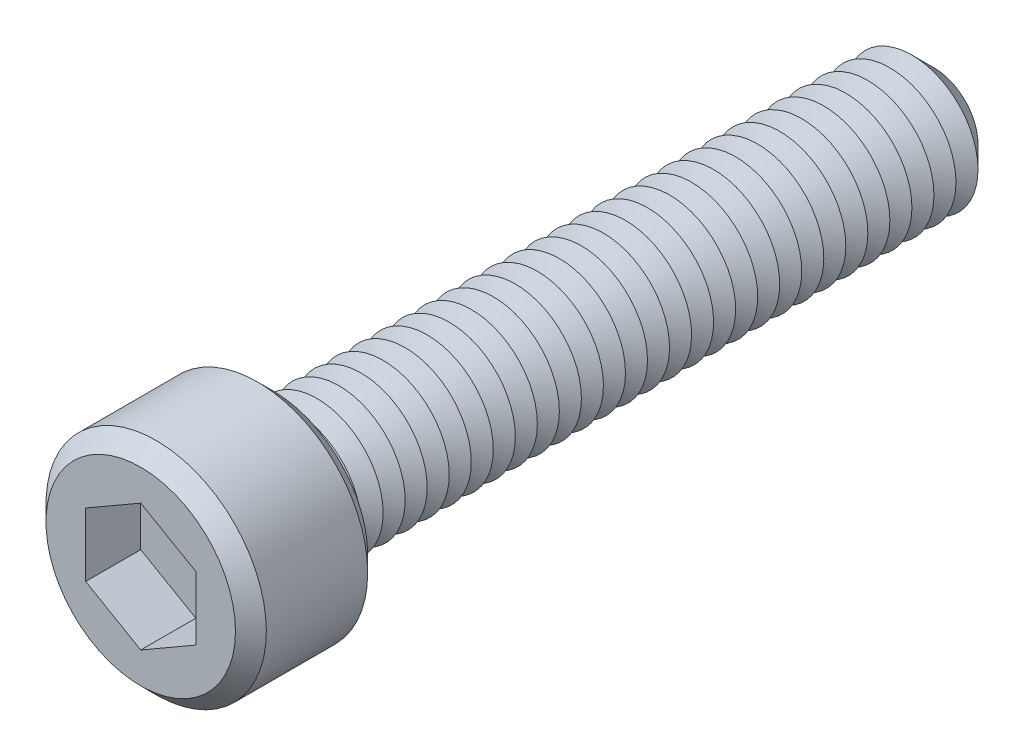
ISO-10303-21;
HEADER;
FILE_DESCRIPTION(('STEP AP214'),'2;1');
FILE_NAME('part.step','',(''),(''),'','','');
FILE_SCHEMA(('AUTOMOTIVE_DESIGN { 1 0 10303 214 1 1 1 1 }'));
ENDSEC;
DATA;
#1=APPLICATION_CONTEXT('core data for automotive mechanical design processes');
#2=APPLICATION_PROTOCOL_DEFINITION('international standard','automotive_design',2000,#1);
#3=PRODUCT_CONTEXT('',#1,'mechanical');
#4=PRODUCT('Part','Part','',(#3));
#5=PRODUCT_RELATED_PRODUCT_CATEGORY('part','',(#4));
#6=PRODUCT_DEFINITION_FORMATION('','',#4);
#7=PRODUCT_DEFINITION_CONTEXT('part definition',#1,'design');
#8=PRODUCT_DEFINITION('design','',#6,#7);
#9=PRODUCT_DEFINITION_SHAPE('','',#8);
#10=(LENGTH_UNIT() NAMED_UNIT(*) SI_UNIT(.MILLI.,.METRE.));
#11=(NAMED_UNIT(*) PLANE_ANGLE_UNIT() SI_UNIT($,.RADIAN.));
#12=(NAMED_UNIT(*) SI_UNIT($,.STERADIAN.) SOLID_ANGLE_UNIT());
#13=UNCERTAINTY_MEASURE_WITH_UNIT(LENGTH_MEASURE(1.E-05),#10,'distance_accuracy_value','');
#14=(GEOMETRIC_REPRESENTATION_CONTEXT(3) GLOBAL_UNCERTAINTY_ASSIGNED_CONTEXT((#13)) GLOBAL_UNIT_ASSIGNED_CONTEXT((#10,
#11,#12)) REPRESENTATION_CONTEXT('',''));
#15=CARTESIAN_POINT('',(0.,0.,0.));
#16=DIRECTION('',(0.,0.,1.));
#17=DIRECTION('',(1.,0.,0.));
#18=AXIS2_PLACEMENT_3D('',#15,#16,#17);
#19=CARTESIAN_POINT('',(0.,0.,6.));
#20=DIRECTION('',(0.,0.,-1.));
#21=DIRECTION('',(-1.,0.,0.));
#22=AXIS2_PLACEMENT_3D('',#19,#20,#21);
#23=CYLINDRICAL_SURFACE('',#22,5.);
#24=CARTESIAN_POINT('',(0.,0.,0.700000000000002));
#25=DIRECTION('',(0.,0.,1.));
#26=DIRECTION('',(1.,0.,0.));
#27=AXIS2_PLACEMENT_3D('',#24,#25,#26);
#28=CIRCLE('',#27,5.);
#29=CARTESIAN_POINT('',(5.,0.,0.700000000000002));
#30=VERTEX_POINT('',#29);
#31=EDGE_CURVE('E409',#30,#30,#28,.T.);
#32=ORIENTED_EDGE('',*,*,#31,.T.);
#33=EDGE_LOOP('',(#32));
#34=FACE_BOUND('',#33,.T.);
#35=CARTESIAN_POINT('',(0.,0.,5.3));
#36=DIRECTION('',(0.,0.,1.));
#37=DIRECTION('',(1.,0.,0.));
#38=AXIS2_PLACEMENT_3D('',#35,#36,#37);
#39=CIRCLE('',#38,5.);
#40=CARTESIAN_POINT('',(5.,0.,5.3));
#41=VERTEX_POINT('',#40);
#42=EDGE_CURVE('E405',#41,#41,#39,.F.);
#43=ORIENTED_EDGE('',*,*,#42,.T.);
#44=EDGE_LOOP('',(#43));
#45=FACE_BOUND('',#44,.T.);
#46=ADVANCED_FACE('F39',(#34,#45),#23,.T.);
#47=CARTESIAN_POINT('',(0.,0.,6.));
#48=DIRECTION('',(0.,0.,1.));
#49=DIRECTION('',(1.,0.,0.));
#50=AXIS2_PLACEMENT_3D('',#47,#48,#49);
#51=PLANE('',#50);
#52=CARTESIAN_POINT('',(0.,0.,6.));
#53=DIRECTION('',(0.,0.,1.));
#54=DIRECTION('',(1.,0.,0.));
#55=AXIS2_PLACEMENT_3D('',#52,#53,#54);
#56=CIRCLE('',#55,4.3);
#57=CARTESIAN_POINT('',(4.3,0.,6.));
#58=VERTEX_POINT('',#57);
#59=EDGE_CURVE('E11',#58,#58,#56,.T.);
#60=ORIENTED_EDGE('',*,*,#59,.T.);
#61=EDGE_LOOP('',(#60));
#62=FACE_BOUND('',#61,.T.);
#63=DIRECTION('',(-0.866025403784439,0.5,0.));
#64=VECTOR('',#63,1.);
#65=CARTESIAN_POINT('',(2.5,1.44337567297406,6.));
#66=LINE('',#65,#64);
#67=CARTESIAN_POINT('',(2.5,1.44337567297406,6.));
#68=VERTEX_POINT('',#67);
#69=CARTESIAN_POINT('',(0.,2.88675134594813,6.));
#70=VERTEX_POINT('',#69);
#71=EDGE_CURVE('E55',#68,#70,#66,.T.);
#72=ORIENTED_EDGE('',*,*,#71,.F.);
#73=DIRECTION('',(0.,1.,0.));
#74=VECTOR('',#73,1.);
#75=CARTESIAN_POINT('',(2.5,-1.44337567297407,6.));
#76=LINE('',#75,#74);
#77=CARTESIAN_POINT('',(2.5,-1.44337567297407,6.));
#78=VERTEX_POINT('',#77);
#79=EDGE_CURVE('E150',#78,#68,#76,.T.);
#80=ORIENTED_EDGE('',*,*,#79,.F.);
#81=DIRECTION('',(0.866025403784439,0.5,0.));
#82=VECTOR('',#81,1.);
#83=CARTESIAN_POINT('',(0.,-2.88675134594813,6.));
#84=LINE('',#83,#82);
#85=CARTESIAN_POINT('',(0.,-2.88675134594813,6.));
#86=VERTEX_POINT('',#85);
#87=EDGE_CURVE('E147',#86,#78,#84,.T.);
#88=ORIENTED_EDGE('',*,*,#87,.F.);
#89=DIRECTION('',(0.866025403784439,-0.5,0.));
#90=VECTOR('',#89,1.);
#91=CARTESIAN_POINT('',(-2.5,-1.44337567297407,6.));
#92=LINE('',#91,#90);
#93=CARTESIAN_POINT('',(-2.5,-1.44337567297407,6.));
#94=VERTEX_POINT('',#93);
#95=EDGE_CURVE('E103',#94,#86,#92,.T.);
#96=ORIENTED_EDGE('',*,*,#95,.F.);
#97=DIRECTION('',(0.,-1.,0.));
#98=VECTOR('',#97,1.);
#99=CARTESIAN_POINT('',(-2.5,1.44337567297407,6.));
#100=LINE('',#99,#98);
#101=CARTESIAN_POINT('',(-2.5,1.44337567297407,6.));
#102=VERTEX_POINT('',#101);
#103=EDGE_CURVE('E141',#102,#94,#100,.T.);
#104=ORIENTED_EDGE('',*,*,#103,.F.);
#105=DIRECTION('',(-0.866025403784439,-0.5,0.));
#106=VECTOR('',#105,1.);
#107=CARTESIAN_POINT('',(0.,2.88675134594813,6.));
#108=LINE('',#107,#106);
#109=EDGE_CURVE('E136',#70,#102,#108,.T.);
#110=ORIENTED_EDGE('',*,*,#109,.F.);
#111=EDGE_LOOP('',(#72,#80,#88,#96,#104,#110));
#112=FACE_BOUND('',#111,.T.);
#113=ADVANCED_FACE('F427',(#62,#112),#51,.T.);
#114=CARTESIAN_POINT('',(0.,0.,0.));
#115=DIRECTION('',(0.,0.,1.));
#116=DIRECTION('',(1.,0.,0.));
#117=AXIS2_PLACEMENT_3D('',#114,#115,#116);
#118=PLANE('',#117);
#119=CARTESIAN_POINT('',(0.,0.,0.));
#120=DIRECTION('',(0.,0.,1.));
#121=DIRECTION('',(1.,0.,0.));
#122=AXIS2_PLACEMENT_3D('',#119,#120,#121);
#123=CIRCLE('',#122,4.29999999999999);
#124=CARTESIAN_POINT('',(4.29999999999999,0.,0.));
#125=VERTEX_POINT('',#124);
#126=EDGE_CURVE('E48',#125,#125,#123,.F.);
#127=ORIENTED_EDGE('',*,*,#126,.T.);
#128=EDGE_LOOP('',(#127));
#129=FACE_BOUND('',#128,.T.);
#130=CARTESIAN_POINT('',(0.,0.,0.));
#131=DIRECTION('',(0.,0.,1.));
#132=DIRECTION('',(1.,0.,0.));
#133=AXIS2_PLACEMENT_3D('',#130,#131,#132);
#134=CIRCLE('',#133,3.);
#135=CARTESIAN_POINT('',(3.,0.,0.));
#136=VERTEX_POINT('',#135);
#137=EDGE_CURVE('E397',#136,#136,#134,.T.);
#138=ORIENTED_EDGE('',*,*,#137,.T.);
#139=EDGE_LOOP('',(#138));
#140=FACE_BOUND('',#139,.T.);
#141=ADVANCED_FACE('F416',(#129,#140),#118,.F.);
#142=CARTESIAN_POINT('',(0.,0.,0.));
#143=DIRECTION('',(0.,0.,1.));
#144=DIRECTION('',(1.,0.,0.));
#145=AXIS2_PLACEMENT_3D('',#142,#143,#144);
#146=CONICAL_SURFACE('',#145,3.,1.0471975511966);
#147=CARTESIAN_POINT('',(0.,0.,-0.500000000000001));
#148=DIRECTION('',(0.,0.,1.));
#149=DIRECTION('',(1.,0.,0.));
#150=AXIS2_PLACEMENT_3D('',#147,#148,#149);
#151=CIRCLE('',#150,2.13397459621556);
#152=CARTESIAN_POINT('',(2.13397459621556,0.,-0.500000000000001));
#153=VERTEX_POINT('',#152);
#154=EDGE_CURVE('E393',#153,#153,#151,.T.);
#155=ORIENTED_EDGE('',*,*,#154,.T.);
#156=EDGE_LOOP('',(#155));
#157=FACE_BOUND('',#156,.T.);
#158=ORIENTED_EDGE('',*,*,#137,.F.);
#159=EDGE_LOOP('',(#158));
#160=FACE_BOUND('',#159,.T.);
#161=ADVANCED_FACE('F708',(#157,#160),#146,.T.);
#162=CARTESIAN_POINT('',(0.,0.,-0.500000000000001));
#163=DIRECTION('',(0.,0.,-1.));
#164=DIRECTION('',(-1.,0.,0.));
#165=AXIS2_PLACEMENT_3D('',#162,#163,#164);
#166=CONICAL_SURFACE('',#165,2.13397459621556,1.0471975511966);
#167=CARTESIAN_POINT('',(0.,0.,-1.));
#168=DIRECTION('',(0.,0.,1.));
#169=DIRECTION('',(1.,0.,0.));
#170=AXIS2_PLACEMENT_3D('',#167,#168,#169);
#171=CIRCLE('',#170,3.);
#172=CARTESIAN_POINT('',(3.,0.,-1.));
#173=VERTEX_POINT('',#172);
#174=EDGE_CURVE('E389',#173,#173,#171,.T.);
#175=ORIENTED_EDGE('',*,*,#174,.T.);
#176=EDGE_LOOP('',(#175));
#177=FACE_BOUND('',#176,.T.);
#178=ORIENTED_EDGE('',*,*,#154,.F.);
#179=EDGE_LOOP('',(#178));
#180=FACE_BOUND('',#179,.T.);
#181=ADVANCED_FACE('F704',(#177,#180),#166,.T.);
#182=CARTESIAN_POINT('',(0.,0.,-1.));
#183=DIRECTION('',(0.,0.,1.));
#184=DIRECTION('',(1.,0.,0.));
#185=AXIS2_PLACEMENT_3D('',#182,#183,#184);
#186=CONICAL_SURFACE('',#185,3.,1.0471975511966);
#187=CARTESIAN_POINT('',(0.,0.,-1.5));
#188=DIRECTION('',(0.,0.,1.));
#189=DIRECTION('',(1.,0.,0.));
#190=AXIS2_PLACEMENT_3D('',#187,#188,#189);
#191=CIRCLE('',#190,2.13397459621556);
#192=CARTESIAN_POINT('',(2.13397459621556,0.,-1.5));
#193=VERTEX_POINT('',#192);
#194=EDGE_CURVE('E385',#193,#193,#191,.T.);
#195=ORIENTED_EDGE('',*,*,#194,.T.);
#196=EDGE_LOOP('',(#195));
#197=FACE_BOUND('',#196,.T.);
#198=ORIENTED_EDGE('',*,*,#174,.F.);
#199=EDGE_LOOP('',(#198));
#200=FACE_BOUND('',#199,.T.);
#201=ADVANCED_FACE('F700',(#197,#200),#186,.T.);
#202=CARTESIAN_POINT('',(0.,0.,-1.5));
#203=DIRECTION('',(0.,0.,-1.));
#204=DIRECTION('',(-1.,0.,0.));
#205=AXIS2_PLACEMENT_3D('',#202,#203,#204);
#206=CONICAL_SURFACE('',#205,2.13397459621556,1.0471975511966);
#207=CARTESIAN_POINT('',(0.,0.,-2.));
#208=DIRECTION('',(0.,0.,1.));
#209=DIRECTION('',(1.,0.,0.));
#210=AXIS2_PLACEMENT_3D('',#207,#208,#209);
#211=CIRCLE('',#210,3.);
#212=CARTESIAN_POINT('',(3.,0.,-2.));
#213=VERTEX_POINT('',#212);
#214=EDGE_CURVE('E381',#213,#213,#211,.T.);
#215=ORIENTED_EDGE('',*,*,#214,.T.);
#216=EDGE_LOOP('',(#215));
#217=FACE_BOUND('',#216,.T.);
#218=ORIENTED_EDGE('',*,*,#194,.F.);
#219=EDGE_LOOP('',(#218));
#220=FACE_BOUND('',#219,.T.);
#221=ADVANCED_FACE('F696',(#217,#220),#206,.T.);
#222=CARTESIAN_POINT('',(0.,0.,-2.));
#223=DIRECTION('',(0.,0.,1.));
#224=DIRECTION('',(1.,0.,0.));
#225=AXIS2_PLACEMENT_3D('',#222,#223,#224);
#226=CONICAL_SURFACE('',#225,3.,1.0471975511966);
#227=CARTESIAN_POINT('',(0.,0.,-2.5));
#228=DIRECTION('',(0.,0.,1.));
#229=DIRECTION('',(1.,0.,0.));
#230=AXIS2_PLACEMENT_3D('',#227,#228,#229);
#231=CIRCLE('',#230,2.13397459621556);
#232=CARTESIAN_POINT('',(2.13397459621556,0.,-2.5));
#233=VERTEX_POINT('',#232);
#234=EDGE_CURVE('E377',#233,#233,#231,.T.);
#235=ORIENTED_EDGE('',*,*,#234,.T.);
#236=EDGE_LOOP('',(#235));
#237=FACE_BOUND('',#236,.T.);
#238=ORIENTED_EDGE('',*,*,#214,.F.);
#239=EDGE_LOOP('',(#238));
#240=FACE_BOUND('',#239,.T.);
#241=ADVANCED_FACE('F692',(#237,#240),#226,.T.);
#242=CARTESIAN_POINT('',(0.,0.,-2.5));
#243=DIRECTION('',(0.,0.,-1.));
#244=DIRECTION('',(-1.,0.,0.));
#245=AXIS2_PLACEMENT_3D('',#242,#243,#244);
#246=CONICAL_SURFACE('',#245,2.13397459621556,1.0471975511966);
#247=CARTESIAN_POINT('',(0.,0.,-3.));
#248=DIRECTION('',(0.,0.,1.));
#249=DIRECTION('',(1.,0.,0.));
#250=AXIS2_PLACEMENT_3D('',#247,#248,#249);
#251=CIRCLE('',#250,3.);
#252=CARTESIAN_POINT('',(3.,0.,-3.));
#253=VERTEX_POINT('',#252);
#254=EDGE_CURVE('E373',#253,#253,#251,.T.);
#255=ORIENTED_EDGE('',*,*,#254,.T.);
#256=EDGE_LOOP('',(#255));
#257=FACE_BOUND('',#256,.T.);
#258=ORIENTED_EDGE('',*,*,#234,.F.);
#259=EDGE_LOOP('',(#258));
#260=FACE_BOUND('',#259,.T.);
#261=ADVANCED_FACE('F688',(#257,#260),#246,.T.);
#262=CARTESIAN_POINT('',(0.,0.,-3.));
#263=DIRECTION('',(0.,0.,1.));
#264=DIRECTION('',(1.,0.,0.));
#265=AXIS2_PLACEMENT_3D('',#262,#263,#264);
#266=CONICAL_SURFACE('',#265,3.,1.0471975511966);
#267=CARTESIAN_POINT('',(0.,0.,-3.5));
#268=DIRECTION('',(0.,0.,1.));
#269=DIRECTION('',(1.,0.,0.));
#270=AXIS2_PLACEMENT_3D('',#267,#268,#269);
#271=CIRCLE('',#270,2.13397459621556);
#272=CARTESIAN_POINT('',(2.13397459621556,0.,-3.5));
#273=VERTEX_POINT('',#272);
#274=EDGE_CURVE('E369',#273,#273,#271,.T.);
#275=ORIENTED_EDGE('',*,*,#274,.T.);
#276=EDGE_LOOP('',(#275));
#277=FACE_BOUND('',#276,.T.);
#278=ORIENTED_EDGE('',*,*,#254,.F.);
#279=EDGE_LOOP('',(#278));
#280=FACE_BOUND('',#279,.T.);
#281=ADVANCED_FACE('F684',(#277,#280),#266,.T.);
#282=CARTESIAN_POINT('',(0.,0.,-3.5));
#283=DIRECTION('',(0.,0.,-1.));
#284=DIRECTION('',(-1.,0.,0.));
#285=AXIS2_PLACEMENT_3D('',#282,#283,#284);
#286=CONICAL_SURFACE('',#285,2.13397459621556,1.0471975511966);
#287=CARTESIAN_POINT('',(0.,0.,-4.));
#288=DIRECTION('',(0.,0.,1.));
#289=DIRECTION('',(1.,0.,0.));
#290=AXIS2_PLACEMENT_3D('',#287,#288,#289);
#291=CIRCLE('',#290,3.);
#292=CARTESIAN_POINT('',(3.,0.,-4.));
#293=VERTEX_POINT('',#292);
#294=EDGE_CURVE('E365',#293,#293,#291,.T.);
#295=ORIENTED_EDGE('',*,*,#294,.T.);
#296=EDGE_LOOP('',(#295));
#297=FACE_BOUND('',#296,.T.);
#298=ORIENTED_EDGE('',*,*,#274,.F.);
#299=EDGE_LOOP('',(#298));
#300=FACE_BOUND('',#299,.T.);
#301=ADVANCED_FACE('F680',(#297,#300),#286,.T.);
#302=CARTESIAN_POINT('',(0.,0.,-4.));
#303=DIRECTION('',(0.,0.,1.));
#304=DIRECTION('',(1.,0.,0.));
#305=AXIS2_PLACEMENT_3D('',#302,#303,#304);
#306=CONICAL_SURFACE('',#305,3.,1.0471975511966);
#307=CARTESIAN_POINT('',(0.,0.,-4.5));
#308=DIRECTION('',(0.,0.,1.));
#309=DIRECTION('',(1.,0.,0.));
#310=AXIS2_PLACEMENT_3D('',#307,#308,#309);
#311=CIRCLE('',#310,2.13397459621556);
#312=CARTESIAN_POINT('',(2.13397459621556,0.,-4.5));
#313=VERTEX_POINT('',#312);
#314=EDGE_CURVE('E361',#313,#313,#311,.T.);
#315=ORIENTED_EDGE('',*,*,#314,.T.);
#316=EDGE_LOOP('',(#315));
#317=FACE_BOUND('',#316,.T.);
#318=ORIENTED_EDGE('',*,*,#294,.F.);
#319=EDGE_LOOP('',(#318));
#320=FACE_BOUND('',#319,.T.);
#321=ADVANCED_FACE('F676',(#317,#320),#306,.T.);
#322=CARTESIAN_POINT('',(0.,0.,-4.5));
#323=DIRECTION('',(0.,0.,-1.));
#324=DIRECTION('',(-1.,0.,0.));
#325=AXIS2_PLACEMENT_3D('',#322,#323,#324);
#326=CONICAL_SURFACE('',#325,2.13397459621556,1.0471975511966);
#327=CARTESIAN_POINT('',(0.,0.,-5.));
#328=DIRECTION('',(0.,0.,1.));
#329=DIRECTION('',(1.,0.,0.));
#330=AXIS2_PLACEMENT_3D('',#327,#328,#329);
#331=CIRCLE('',#330,3.);
#332=CARTESIAN_POINT('',(3.,0.,-5.));
#333=VERTEX_POINT('',#332);
#334=EDGE_CURVE('E357',#333,#333,#331,.T.);
#335=ORIENTED_EDGE('',*,*,#334,.T.);
#336=EDGE_LOOP('',(#335));
#337=FACE_BOUND('',#336,.T.);
#338=ORIENTED_EDGE('',*,*,#314,.F.);
#339=EDGE_LOOP('',(#338));
#340=FACE_BOUND('',#339,.T.);
#341=ADVANCED_FACE('F672',(#337,#340),#326,.T.);
#342=CARTESIAN_POINT('',(0.,0.,-5.));
#343=DIRECTION('',(0.,0.,1.));
#344=DIRECTION('',(1.,0.,0.));
#345=AXIS2_PLACEMENT_3D('',#342,#343,#344);
#346=CONICAL_SURFACE('',#345,3.,1.0471975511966);
#347=CARTESIAN_POINT('',(0.,0.,-5.5));
#348=DIRECTION('',(0.,0.,1.));
#349=DIRECTION('',(1.,0.,0.));
#350=AXIS2_PLACEMENT_3D('',#347,#348,#349);
#351=CIRCLE('',#350,2.13397459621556);
#352=CARTESIAN_POINT('',(2.13397459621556,0.,-5.5));
#353=VERTEX_POINT('',#352);
#354=EDGE_CURVE('E353',#353,#353,#351,.T.);
#355=ORIENTED_EDGE('',*,*,#354,.T.);
#356=EDGE_LOOP('',(#355));
#357=FACE_BOUND('',#356,.T.);
#358=ORIENTED_EDGE('',*,*,#334,.F.);
#359=EDGE_LOOP('',(#358));
#360=FACE_BOUND('',#359,.T.);
#361=ADVANCED_FACE('F668',(#357,#360),#346,.T.);
#362=CARTESIAN_POINT('',(0.,0.,-5.5));
#363=DIRECTION('',(0.,0.,-1.));
#364=DIRECTION('',(-1.,0.,0.));
#365=AXIS2_PLACEMENT_3D('',#362,#363,#364);
#366=CONICAL_SURFACE('',#365,2.13397459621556,1.0471975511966);
#367=CARTESIAN_POINT('',(0.,0.,-6.));
#368=DIRECTION('',(0.,0.,1.));
#369=DIRECTION('',(1.,0.,0.));
#370=AXIS2_PLACEMENT_3D('',#367,#368,#369);
#371=CIRCLE('',#370,3.);
#372=CARTESIAN_POINT('',(3.,0.,-6.));
#373=VERTEX_POINT('',#372);
#374=EDGE_CURVE('E349',#373,#373,#371,.T.);
#375=ORIENTED_EDGE('',*,*,#374,.T.);
#376=EDGE_LOOP('',(#375));
#377=FACE_BOUND('',#376,.T.);
#378=ORIENTED_EDGE('',*,*,#354,.F.);
#379=EDGE_LOOP('',(#378));
#380=FACE_BOUND('',#379,.T.);
#381=ADVANCED_FACE('F664',(#377,#380),#366,.T.);
#382=CARTESIAN_POINT('',(0.,0.,-6.));
#383=DIRECTION('',(0.,0.,1.));
#384=DIRECTION('',(1.,0.,0.));
#385=AXIS2_PLACEMENT_3D('',#382,#383,#384);
#386=CONICAL_SURFACE('',#385,3.,1.0471975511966);
#387=CARTESIAN_POINT('',(0.,0.,-6.5));
#388=DIRECTION('',(0.,0.,1.));
#389=DIRECTION('',(1.,0.,0.));
#390=AXIS2_PLACEMENT_3D('',#387,#388,#389);
#391=CIRCLE('',#390,2.13397459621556);
#392=CARTESIAN_POINT('',(2.13397459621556,0.,-6.5));
#393=VERTEX_POINT('',#392);
#394=EDGE_CURVE('E345',#393,#393,#391,.T.);
#395=ORIENTED_EDGE('',*,*,#394,.T.);
#396=EDGE_LOOP('',(#395));
#397=FACE_BOUND('',#396,.T.);
#398=ORIENTED_EDGE('',*,*,#374,.F.);
#399=EDGE_LOOP('',(#398));
#400=FACE_BOUND('',#399,.T.);
#401=ADVANCED_FACE('F660',(#397,#400),#386,.T.);
#402=CARTESIAN_POINT('',(0.,0.,-6.5));
#403=DIRECTION('',(0.,0.,-1.));
#404=DIRECTION('',(-1.,0.,0.));
#405=AXIS2_PLACEMENT_3D('',#402,#403,#404);
#406=CONICAL_SURFACE('',#405,2.13397459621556,1.0471975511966);
#407=CARTESIAN_POINT('',(0.,0.,-7.));
#408=DIRECTION('',(0.,0.,1.));
#409=DIRECTION('',(1.,0.,0.));
#410=AXIS2_PLACEMENT_3D('',#407,#408,#409);
#411=CIRCLE('',#410,3.);
#412=CARTESIAN_POINT('',(3.,0.,-7.));
#413=VERTEX_POINT('',#412);
#414=EDGE_CURVE('E341',#413,#413,#411,.T.);
#415=ORIENTED_EDGE('',*,*,#414,.T.);
#416=EDGE_LOOP('',(#415));
#417=FACE_BOUND('',#416,.T.);
#418=ORIENTED_EDGE('',*,*,#394,.F.);
#419=EDGE_LOOP('',(#418));
#420=FACE_BOUND('',#419,.T.);
#421=ADVANCED_FACE('F656',(#417,#420),#406,.T.);
#422=CARTESIAN_POINT('',(0.,0.,-7.));
#423=DIRECTION('',(0.,0.,1.));
#424=DIRECTION('',(1.,0.,0.));
#425=AXIS2_PLACEMENT_3D('',#422,#423,#424);
#426=CONICAL_SURFACE('',#425,3.,1.0471975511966);
#427=CARTESIAN_POINT('',(0.,0.,-7.5));
#428=DIRECTION('',(0.,0.,1.));
#429=DIRECTION('',(1.,0.,0.));
#430=AXIS2_PLACEMENT_3D('',#427,#428,#429);
#431=CIRCLE('',#430,2.13397459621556);
#432=CARTESIAN_POINT('',(2.13397459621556,0.,-7.5));
#433=VERTEX_POINT('',#432);
#434=EDGE_CURVE('E337',#433,#433,#431,.T.);
#435=ORIENTED_EDGE('',*,*,#434,.T.);
#436=EDGE_LOOP('',(#435));
#437=FACE_BOUND('',#436,.T.);
#438=ORIENTED_EDGE('',*,*,#414,.F.);
#439=EDGE_LOOP('',(#438));
#440=FACE_BOUND('',#439,.T.);
#441=ADVANCED_FACE('F652',(#437,#440),#426,.T.);
#442=CARTESIAN_POINT('',(0.,0.,-7.5));
#443=DIRECTION('',(0.,0.,-1.));
#444=DIRECTION('',(-1.,0.,0.));
#445=AXIS2_PLACEMENT_3D('',#442,#443,#444);
#446=CONICAL_SURFACE('',#445,2.13397459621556,1.0471975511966);
#447=CARTESIAN_POINT('',(0.,0.,-8.));
#448=DIRECTION('',(0.,0.,1.));
#449=DIRECTION('',(1.,0.,0.));
#450=AXIS2_PLACEMENT_3D('',#447,#448,#449);
#451=CIRCLE('',#450,3.);
#452=CARTESIAN_POINT('',(3.,0.,-8.));
#453=VERTEX_POINT('',#452);
#454=EDGE_CURVE('E333',#453,#453,#451,.T.);
#455=ORIENTED_EDGE('',*,*,#454,.T.);
#456=EDGE_LOOP('',(#455));
#457=FACE_BOUND('',#456,.T.);
#458=ORIENTED_EDGE('',*,*,#434,.F.);
#459=EDGE_LOOP('',(#458));
#460=FACE_BOUND('',#459,.T.);
#461=ADVANCED_FACE('F648',(#457,#460),#446,.T.);
#462=CARTESIAN_POINT('',(0.,0.,-8.));
#463=DIRECTION('',(0.,0.,1.));
#464=DIRECTION('',(1.,0.,0.));
#465=AXIS2_PLACEMENT_3D('',#462,#463,#464);
#466=CONICAL_SURFACE('',#465,3.,1.0471975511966);
#467=CARTESIAN_POINT('',(0.,0.,-8.5));
#468=DIRECTION('',(0.,0.,1.));
#469=DIRECTION('',(1.,0.,0.));
#470=AXIS2_PLACEMENT_3D('',#467,#468,#469);
#471=CIRCLE('',#470,2.13397459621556);
#472=CARTESIAN_POINT('',(2.13397459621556,0.,-8.5));
#473=VERTEX_POINT('',#472);
#474=EDGE_CURVE('E329',#473,#473,#471,.T.);
#475=ORIENTED_EDGE('',*,*,#474,.T.);
#476=EDGE_LOOP('',(#475));
#477=FACE_BOUND('',#476,.T.);
#478=ORIENTED_EDGE('',*,*,#454,.F.);
#479=EDGE_LOOP('',(#478));
#480=FACE_BOUND('',#479,.T.);
#481=ADVANCED_FACE('F644',(#477,#480),#466,.T.);
#482=CARTESIAN_POINT('',(0.,0.,-8.5));
#483=DIRECTION('',(0.,0.,-1.));
#484=DIRECTION('',(-1.,0.,0.));
#485=AXIS2_PLACEMENT_3D('',#482,#483,#484);
#486=CONICAL_SURFACE('',#485,2.13397459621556,1.0471975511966);
#487=CARTESIAN_POINT('',(0.,0.,-9.));
#488=DIRECTION('',(0.,0.,1.));
#489=DIRECTION('',(1.,0.,0.));
#490=AXIS2_PLACEMENT_3D('',#487,#488,#489);
#491=CIRCLE('',#490,3.);
#492=CARTESIAN_POINT('',(3.,0.,-9.));
#493=VERTEX_POINT('',#492);
#494=EDGE_CURVE('E325',#493,#493,#491,.T.);
#495=ORIENTED_EDGE('',*,*,#494,.T.);
#496=EDGE_LOOP('',(#495));
#497=FACE_BOUND('',#496,.T.);
#498=ORIENTED_EDGE('',*,*,#474,.F.);
#499=EDGE_LOOP('',(#498));
#500=FACE_BOUND('',#499,.T.);
#501=ADVANCED_FACE('F640',(#497,#500),#486,.T.);
#502=CARTESIAN_POINT('',(0.,0.,-9.));
#503=DIRECTION('',(0.,0.,1.));
#504=DIRECTION('',(1.,0.,0.));
#505=AXIS2_PLACEMENT_3D('',#502,#503,#504);
#506=CONICAL_SURFACE('',#505,3.,1.0471975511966);
#507=CARTESIAN_POINT('',(0.,0.,-9.5));
#508=DIRECTION('',(0.,0.,1.));
#509=DIRECTION('',(1.,0.,0.));
#510=AXIS2_PLACEMENT_3D('',#507,#508,#509);
#511=CIRCLE('',#510,2.13397459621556);
#512=CARTESIAN_POINT('',(2.13397459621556,0.,-9.5));
#513=VERTEX_POINT('',#512);
#514=EDGE_CURVE('E321',#513,#513,#511,.T.);
#515=ORIENTED_EDGE('',*,*,#514,.T.);
#516=EDGE_LOOP('',(#515));
#517=FACE_BOUND('',#516,.T.);
#518=ORIENTED_EDGE('',*,*,#494,.F.);
#519=EDGE_LOOP('',(#518));
#520=FACE_BOUND('',#519,.T.);
#521=ADVANCED_FACE('F636',(#517,#520),#506,.T.);
#522=CARTESIAN_POINT('',(0.,0.,-9.5));
#523=DIRECTION('',(0.,0.,-1.));
#524=DIRECTION('',(-1.,0.,0.));
#525=AXIS2_PLACEMENT_3D('',#522,#523,#524);
#526=CONICAL_SURFACE('',#525,2.13397459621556,1.0471975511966);
#527=CARTESIAN_POINT('',(0.,0.,-10.));
#528=DIRECTION('',(0.,0.,1.));
#529=DIRECTION('',(1.,0.,0.));
#530=AXIS2_PLACEMENT_3D('',#527,#528,#529);
#531=CIRCLE('',#530,3.);
#532=CARTESIAN_POINT('',(3.,0.,-10.));
#533=VERTEX_POINT('',#532);
#534=EDGE_CURVE('E317',#533,#533,#531,.T.);
#535=ORIENTED_EDGE('',*,*,#534,.T.);
#536=EDGE_LOOP('',(#535));
#537=FACE_BOUND('',#536,.T.);
#538=ORIENTED_EDGE('',*,*,#514,.F.);
#539=EDGE_LOOP('',(#538));
#540=FACE_BOUND('',#539,.T.);
#541=ADVANCED_FACE('F632',(#537,#540),#526,.T.);
#542=CARTESIAN_POINT('',(0.,0.,-10.));
#543=DIRECTION('',(0.,0.,1.));
#544=DIRECTION('',(1.,0.,0.));
#545=AXIS2_PLACEMENT_3D('',#542,#543,#544);
#546=CONICAL_SURFACE('',#545,3.,1.0471975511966);
#547=CARTESIAN_POINT('',(0.,0.,-10.5));
#548=DIRECTION('',(0.,0.,1.));
#549=DIRECTION('',(1.,0.,0.));
#550=AXIS2_PLACEMENT_3D('',#547,#548,#549);
#551=CIRCLE('',#550,2.13397459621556);
#552=CARTESIAN_POINT('',(2.13397459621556,0.,-10.5));
#553=VERTEX_POINT('',#552);
#554=EDGE_CURVE('E313',#553,#553,#551,.T.);
#555=ORIENTED_EDGE('',*,*,#554,.T.);
#556=EDGE_LOOP('',(#555));
#557=FACE_BOUND('',#556,.T.);
#558=ORIENTED_EDGE('',*,*,#534,.F.);
#559=EDGE_LOOP('',(#558));
#560=FACE_BOUND('',#559,.T.);
#561=ADVANCED_FACE('F628',(#557,#560),#546,.T.);
#562=CARTESIAN_POINT('',(0.,0.,-10.5));
#563=DIRECTION('',(0.,0.,-1.));
#564=DIRECTION('',(-1.,0.,0.));
#565=AXIS2_PLACEMENT_3D('',#562,#563,#564);
#566=CONICAL_SURFACE('',#565,2.13397459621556,1.0471975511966);
#567=CARTESIAN_POINT('',(0.,0.,-11.));
#568=DIRECTION('',(0.,0.,1.));
#569=DIRECTION('',(1.,0.,0.));
#570=AXIS2_PLACEMENT_3D('',#567,#568,#569);
#571=CIRCLE('',#570,3.);
#572=CARTESIAN_POINT('',(3.,0.,-11.));
#573=VERTEX_POINT('',#572);
#574=EDGE_CURVE('E309',#573,#573,#571,.T.);
#575=ORIENTED_EDGE('',*,*,#574,.T.);
#576=EDGE_LOOP('',(#575));
#577=FACE_BOUND('',#576,.T.);
#578=ORIENTED_EDGE('',*,*,#554,.F.);
#579=EDGE_LOOP('',(#578));
#580=FACE_BOUND('',#579,.T.);
#581=ADVANCED_FACE('F624',(#577,#580),#566,.T.);
#582=CARTESIAN_POINT('',(0.,0.,-11.));
#583=DIRECTION('',(0.,0.,1.));
#584=DIRECTION('',(1.,0.,0.));
#585=AXIS2_PLACEMENT_3D('',#582,#583,#584);
#586=CONICAL_SURFACE('',#585,3.,1.0471975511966);
#587=CARTESIAN_POINT('',(0.,0.,-11.5));
#588=DIRECTION('',(0.,0.,1.));
#589=DIRECTION('',(1.,0.,0.));
#590=AXIS2_PLACEMENT_3D('',#587,#588,#589);
#591=CIRCLE('',#590,2.13397459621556);
#592=CARTESIAN_POINT('',(2.13397459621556,0.,-11.5));
#593=VERTEX_POINT('',#592);
#594=EDGE_CURVE('E305',#593,#593,#591,.T.);
#595=ORIENTED_EDGE('',*,*,#594,.T.);
#596=EDGE_LOOP('',(#595));
#597=FACE_BOUND('',#596,.T.);
#598=ORIENTED_EDGE('',*,*,#574,.F.);
#599=EDGE_LOOP('',(#598));
#600=FACE_BOUND('',#599,.T.);
#601=ADVANCED_FACE('F620',(#597,#600),#586,.T.);
#602=CARTESIAN_POINT('',(0.,0.,-11.5));
#603=DIRECTION('',(0.,0.,-1.));
#604=DIRECTION('',(-1.,0.,0.));
#605=AXIS2_PLACEMENT_3D('',#602,#603,#604);
#606=CONICAL_SURFACE('',#605,2.13397459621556,1.0471975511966);
#607=CARTESIAN_POINT('',(0.,0.,-12.));
#608=DIRECTION('',(0.,0.,1.));
#609=DIRECTION('',(1.,0.,0.));
#610=AXIS2_PLACEMENT_3D('',#607,#608,#609);
#611=CIRCLE('',#610,3.);
#612=CARTESIAN_POINT('',(3.,0.,-12.));
#613=VERTEX_POINT('',#612);
#614=EDGE_CURVE('E301',#613,#613,#611,.T.);
#615=ORIENTED_EDGE('',*,*,#614,.T.);
#616=EDGE_LOOP('',(#615));
#617=FACE_BOUND('',#616,.T.);
#618=ORIENTED_EDGE('',*,*,#594,.F.);
#619=EDGE_LOOP('',(#618));
#620=FACE_BOUND('',#619,.T.);
#621=ADVANCED_FACE('F616',(#617,#620),#606,.T.);
#622=CARTESIAN_POINT('',(0.,0.,-12.));
#623=DIRECTION('',(0.,0.,1.));
#624=DIRECTION('',(1.,0.,0.));
#625=AXIS2_PLACEMENT_3D('',#622,#623,#624);
#626=CONICAL_SURFACE('',#625,3.,1.0471975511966);
#627=CARTESIAN_POINT('',(0.,0.,-12.5));
#628=DIRECTION('',(0.,0.,1.));
#629=DIRECTION('',(1.,0.,0.));
#630=AXIS2_PLACEMENT_3D('',#627,#628,#629);
#631=CIRCLE('',#630,2.13397459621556);
#632=CARTESIAN_POINT('',(2.13397459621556,0.,-12.5));
#633=VERTEX_POINT('',#632);
#634=EDGE_CURVE('E297',#633,#633,#631,.T.);
#635=ORIENTED_EDGE('',*,*,#634,.T.);
#636=EDGE_LOOP('',(#635));
#637=FACE_BOUND('',#636,.T.);
#638=ORIENTED_EDGE('',*,*,#614,.F.);
#639=EDGE_LOOP('',(#638));
#640=FACE_BOUND('',#639,.T.);
#641=ADVANCED_FACE('F612',(#637,#640),#626,.T.);
#642=CARTESIAN_POINT('',(0.,0.,-12.5));
#643=DIRECTION('',(0.,0.,-1.));
#644=DIRECTION('',(-1.,0.,0.));
#645=AXIS2_PLACEMENT_3D('',#642,#643,#644);
#646=CONICAL_SURFACE('',#645,2.13397459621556,1.0471975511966);
#647=CARTESIAN_POINT('',(0.,0.,-13.));
#648=DIRECTION('',(0.,0.,1.));
#649=DIRECTION('',(1.,0.,0.));
#650=AXIS2_PLACEMENT_3D('',#647,#648,#649);
#651=CIRCLE('',#650,3.);
#652=CARTESIAN_POINT('',(3.,0.,-13.));
#653=VERTEX_POINT('',#652);
#654=EDGE_CURVE('E293',#653,#653,#651,.T.);
#655=ORIENTED_EDGE('',*,*,#654,.T.);
#656=EDGE_LOOP('',(#655));
#657=FACE_BOUND('',#656,.T.);
#658=ORIENTED_EDGE('',*,*,#634,.F.);
#659=EDGE_LOOP('',(#658));
#660=FACE_BOUND('',#659,.T.);
#661=ADVANCED_FACE('F608',(#657,#660),#646,.T.);
#662=CARTESIAN_POINT('',(0.,0.,-13.));
#663=DIRECTION('',(0.,0.,1.));
#664=DIRECTION('',(1.,0.,0.));
#665=AXIS2_PLACEMENT_3D('',#662,#663,#664);
#666=CONICAL_SURFACE('',#665,3.,1.0471975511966);
#667=CARTESIAN_POINT('',(0.,0.,-13.5));
#668=DIRECTION('',(0.,0.,1.));
#669=DIRECTION('',(1.,0.,0.));
#670=AXIS2_PLACEMENT_3D('',#667,#668,#669);
#671=CIRCLE('',#670,2.13397459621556);
#672=CARTESIAN_POINT('',(2.13397459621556,0.,-13.5));
#673=VERTEX_POINT('',#672);
#674=EDGE_CURVE('E289',#673,#673,#671,.T.);
#675=ORIENTED_EDGE('',*,*,#674,.T.);
#676=EDGE_LOOP('',(#675));
#677=FACE_BOUND('',#676,.T.);
#678=ORIENTED_EDGE('',*,*,#654,.F.);
#679=EDGE_LOOP('',(#678));
#680=FACE_BOUND('',#679,.T.);
#681=ADVANCED_FACE('F604',(#677,#680),#666,.T.);
#682=CARTESIAN_POINT('',(0.,0.,-13.5));
#683=DIRECTION('',(0.,0.,-1.));
#684=DIRECTION('',(-1.,0.,0.));
#685=AXIS2_PLACEMENT_3D('',#682,#683,#684);
#686=CONICAL_SURFACE('',#685,2.13397459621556,1.0471975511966);
#687=CARTESIAN_POINT('',(0.,0.,-14.));
#688=DIRECTION('',(0.,0.,1.));
#689=DIRECTION('',(1.,0.,0.));
#690=AXIS2_PLACEMENT_3D('',#687,#688,#689);
#691=CIRCLE('',#690,3.);
#692=CARTESIAN_POINT('',(3.,0.,-14.));
#693=VERTEX_POINT('',#692);
#694=EDGE_CURVE('E285',#693,#693,#691,.T.);
#695=ORIENTED_EDGE('',*,*,#694,.T.);
#696=EDGE_LOOP('',(#695));
#697=FACE_BOUND('',#696,.T.);
#698=ORIENTED_EDGE('',*,*,#674,.F.);
#699=EDGE_LOOP('',(#698));
#700=FACE_BOUND('',#699,.T.);
#701=ADVANCED_FACE('F600',(#697,#700),#686,.T.);
#702=CARTESIAN_POINT('',(0.,0.,-14.));
#703=DIRECTION('',(0.,0.,1.));
#704=DIRECTION('',(1.,0.,0.));
#705=AXIS2_PLACEMENT_3D('',#702,#703,#704);
#706=CONICAL_SURFACE('',#705,3.,1.0471975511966);
#707=CARTESIAN_POINT('',(0.,0.,-14.5));
#708=DIRECTION('',(0.,0.,1.));
#709=DIRECTION('',(1.,0.,0.));
#710=AXIS2_PLACEMENT_3D('',#707,#708,#709);
#711=CIRCLE('',#710,2.13397459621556);
#712=CARTESIAN_POINT('',(2.13397459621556,0.,-14.5));
#713=VERTEX_POINT('',#712);
#714=EDGE_CURVE('E281',#713,#713,#711,.T.);
#715=ORIENTED_EDGE('',*,*,#714,.T.);
#716=EDGE_LOOP('',(#715));
#717=FACE_BOUND('',#716,.T.);
#718=ORIENTED_EDGE('',*,*,#694,.F.);
#719=EDGE_LOOP('',(#718));
#720=FACE_BOUND('',#719,.T.);
#721=ADVANCED_FACE('F596',(#717,#720),#706,.T.);
#722=CARTESIAN_POINT('',(0.,0.,-14.5));
#723=DIRECTION('',(0.,0.,-1.));
#724=DIRECTION('',(-1.,0.,0.));
#725=AXIS2_PLACEMENT_3D('',#722,#723,#724);
#726=CONICAL_SURFACE('',#725,2.13397459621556,1.0471975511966);
#727=CARTESIAN_POINT('',(0.,0.,-15.));
#728=DIRECTION('',(0.,0.,1.));
#729=DIRECTION('',(1.,0.,0.));
#730=AXIS2_PLACEMENT_3D('',#727,#728,#729);
#731=CIRCLE('',#730,3.);
#732=CARTESIAN_POINT('',(3.,0.,-15.));
#733=VERTEX_POINT('',#732);
#734=EDGE_CURVE('E277',#733,#733,#731,.T.);
#735=ORIENTED_EDGE('',*,*,#734,.T.);
#736=EDGE_LOOP('',(#735));
#737=FACE_BOUND('',#736,.T.);
#738=ORIENTED_EDGE('',*,*,#714,.F.);
#739=EDGE_LOOP('',(#738));
#740=FACE_BOUND('',#739,.T.);
#741=ADVANCED_FACE('F592',(#737,#740),#726,.T.);
#742=CARTESIAN_POINT('',(0.,0.,-15.));
#743=DIRECTION('',(0.,0.,1.));
#744=DIRECTION('',(1.,0.,0.));
#745=AXIS2_PLACEMENT_3D('',#742,#743,#744);
#746=CONICAL_SURFACE('',#745,3.,1.0471975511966);
#747=CARTESIAN_POINT('',(0.,0.,-15.5));
#748=DIRECTION('',(0.,0.,1.));
#749=DIRECTION('',(1.,0.,0.));
#750=AXIS2_PLACEMENT_3D('',#747,#748,#749);
#751=CIRCLE('',#750,2.13397459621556);
#752=CARTESIAN_POINT('',(2.13397459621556,0.,-15.5));
#753=VERTEX_POINT('',#752);
#754=EDGE_CURVE('E273',#753,#753,#751,.T.);
#755=ORIENTED_EDGE('',*,*,#754,.T.);
#756=EDGE_LOOP('',(#755));
#757=FACE_BOUND('',#756,.T.);
#758=ORIENTED_EDGE('',*,*,#734,.F.);
#759=EDGE_LOOP('',(#758));
#760=FACE_BOUND('',#759,.T.);
#761=ADVANCED_FACE('F588',(#757,#760),#746,.T.);
#762=CARTESIAN_POINT('',(0.,0.,-15.5));
#763=DIRECTION('',(0.,0.,-1.));
#764=DIRECTION('',(-1.,0.,0.));
#765=AXIS2_PLACEMENT_3D('',#762,#763,#764);
#766=CONICAL_SURFACE('',#765,2.13397459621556,1.0471975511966);
#767=CARTESIAN_POINT('',(0.,0.,-16.));
#768=DIRECTION('',(0.,0.,1.));
#769=DIRECTION('',(1.,0.,0.));
#770=AXIS2_PLACEMENT_3D('',#767,#768,#769);
#771=CIRCLE('',#770,3.);
#772=CARTESIAN_POINT('',(3.,0.,-16.));
#773=VERTEX_POINT('',#772);
#774=EDGE_CURVE('E269',#773,#773,#771,.T.);
#775=ORIENTED_EDGE('',*,*,#774,.T.);
#776=EDGE_LOOP('',(#775));
#777=FACE_BOUND('',#776,.T.);
#778=ORIENTED_EDGE('',*,*,#754,.F.);
#779=EDGE_LOOP('',(#778));
#780=FACE_BOUND('',#779,.T.);
#781=ADVANCED_FACE('F584',(#777,#780),#766,.T.);
#782=CARTESIAN_POINT('',(0.,0.,-16.));
#783=DIRECTION('',(0.,0.,1.));
#784=DIRECTION('',(1.,0.,0.));
#785=AXIS2_PLACEMENT_3D('',#782,#783,#784);
#786=CONICAL_SURFACE('',#785,3.,1.0471975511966);
#787=CARTESIAN_POINT('',(0.,0.,-16.5));
#788=DIRECTION('',(0.,0.,1.));
#789=DIRECTION('',(1.,0.,0.));
#790=AXIS2_PLACEMENT_3D('',#787,#788,#789);
#791=CIRCLE('',#790,2.13397459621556);
#792=CARTESIAN_POINT('',(2.13397459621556,0.,-16.5));
#793=VERTEX_POINT('',#792);
#794=EDGE_CURVE('E265',#793,#793,#791,.T.);
#795=ORIENTED_EDGE('',*,*,#794,.T.);
#796=EDGE_LOOP('',(#795));
#797=FACE_BOUND('',#796,.T.);
#798=ORIENTED_EDGE('',*,*,#774,.F.);
#799=EDGE_LOOP('',(#798));
#800=FACE_BOUND('',#799,.T.);
#801=ADVANCED_FACE('F580',(#797,#800),#786,.T.);
#802=CARTESIAN_POINT('',(0.,0.,-16.5));
#803=DIRECTION('',(0.,0.,-1.));
#804=DIRECTION('',(-1.,0.,0.));
#805=AXIS2_PLACEMENT_3D('',#802,#803,#804);
#806=CONICAL_SURFACE('',#805,2.13397459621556,1.0471975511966);
#807=CARTESIAN_POINT('',(0.,0.,-17.));
#808=DIRECTION('',(0.,0.,1.));
#809=DIRECTION('',(1.,0.,0.));
#810=AXIS2_PLACEMENT_3D('',#807,#808,#809);
#811=CIRCLE('',#810,3.);
#812=CARTESIAN_POINT('',(3.,0.,-17.));
#813=VERTEX_POINT('',#812);
#814=EDGE_CURVE('E261',#813,#813,#811,.T.);
#815=ORIENTED_EDGE('',*,*,#814,.T.);
#816=EDGE_LOOP('',(#815));
#817=FACE_BOUND('',#816,.T.);
#818=ORIENTED_EDGE('',*,*,#794,.F.);
#819=EDGE_LOOP('',(#818));
#820=FACE_BOUND('',#819,.T.);
#821=ADVANCED_FACE('F576',(#817,#820),#806,.T.);
#822=CARTESIAN_POINT('',(0.,0.,-17.));
#823=DIRECTION('',(0.,0.,1.));
#824=DIRECTION('',(1.,0.,0.));
#825=AXIS2_PLACEMENT_3D('',#822,#823,#824);
#826=CONICAL_SURFACE('',#825,3.,1.0471975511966);
#827=CARTESIAN_POINT('',(0.,0.,-17.5));
#828=DIRECTION('',(0.,0.,1.));
#829=DIRECTION('',(1.,0.,0.));
#830=AXIS2_PLACEMENT_3D('',#827,#828,#829);
#831=CIRCLE('',#830,2.13397459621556);
#832=CARTESIAN_POINT('',(2.13397459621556,0.,-17.5));
#833=VERTEX_POINT('',#832);
#834=EDGE_CURVE('E257',#833,#833,#831,.T.);
#835=ORIENTED_EDGE('',*,*,#834,.T.);
#836=EDGE_LOOP('',(#835));
#837=FACE_BOUND('',#836,.T.);
#838=ORIENTED_EDGE('',*,*,#814,.F.);
#839=EDGE_LOOP('',(#838));
#840=FACE_BOUND('',#839,.T.);
#841=ADVANCED_FACE('F572',(#837,#840),#826,.T.);
#842=CARTESIAN_POINT('',(0.,0.,-17.5));
#843=DIRECTION('',(0.,0.,-1.));
#844=DIRECTION('',(-1.,0.,0.));
#845=AXIS2_PLACEMENT_3D('',#842,#843,#844);
#846=CONICAL_SURFACE('',#845,2.13397459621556,1.0471975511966);
#847=CARTESIAN_POINT('',(0.,0.,-18.));
#848=DIRECTION('',(0.,0.,1.));
#849=DIRECTION('',(1.,0.,0.));
#850=AXIS2_PLACEMENT_3D('',#847,#848,#849);
#851=CIRCLE('',#850,3.);
#852=CARTESIAN_POINT('',(3.,0.,-18.));
#853=VERTEX_POINT('',#852);
#854=EDGE_CURVE('E253',#853,#853,#851,.T.);
#855=ORIENTED_EDGE('',*,*,#854,.T.);
#856=EDGE_LOOP('',(#855));
#857=FACE_BOUND('',#856,.T.);
#858=ORIENTED_EDGE('',*,*,#834,.F.);
#859=EDGE_LOOP('',(#858));
#860=FACE_BOUND('',#859,.T.);
#861=ADVANCED_FACE('F568',(#857,#860),#846,.T.);
#862=CARTESIAN_POINT('',(0.,0.,-18.));
#863=DIRECTION('',(0.,0.,1.));
#864=DIRECTION('',(1.,0.,0.));
#865=AXIS2_PLACEMENT_3D('',#862,#863,#864);
#866=CONICAL_SURFACE('',#865,3.,1.0471975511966);
#867=CARTESIAN_POINT('',(0.,0.,-18.5));
#868=DIRECTION('',(0.,0.,1.));
#869=DIRECTION('',(1.,0.,0.));
#870=AXIS2_PLACEMENT_3D('',#867,#868,#869);
#871=CIRCLE('',#870,2.13397459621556);
#872=CARTESIAN_POINT('',(2.13397459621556,0.,-18.5));
#873=VERTEX_POINT('',#872);
#874=EDGE_CURVE('E249',#873,#873,#871,.T.);
#875=ORIENTED_EDGE('',*,*,#874,.T.);
#876=EDGE_LOOP('',(#875));
#877=FACE_BOUND('',#876,.T.);
#878=ORIENTED_EDGE('',*,*,#854,.F.);
#879=EDGE_LOOP('',(#878));
#880=FACE_BOUND('',#879,.T.);
#881=ADVANCED_FACE('F564',(#877,#880),#866,.T.);
#882=CARTESIAN_POINT('',(0.,0.,-18.5));
#883=DIRECTION('',(0.,0.,-1.));
#884=DIRECTION('',(-1.,0.,0.));
#885=AXIS2_PLACEMENT_3D('',#882,#883,#884);
#886=CONICAL_SURFACE('',#885,2.13397459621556,1.0471975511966);
#887=CARTESIAN_POINT('',(0.,0.,-19.));
#888=DIRECTION('',(0.,0.,1.));
#889=DIRECTION('',(1.,0.,0.));
#890=AXIS2_PLACEMENT_3D('',#887,#888,#889);
#891=CIRCLE('',#890,3.);
#892=CARTESIAN_POINT('',(3.,0.,-19.));
#893=VERTEX_POINT('',#892);
#894=EDGE_CURVE('E245',#893,#893,#891,.T.);
#895=ORIENTED_EDGE('',*,*,#894,.T.);
#896=EDGE_LOOP('',(#895));
#897=FACE_BOUND('',#896,.T.);
#898=ORIENTED_EDGE('',*,*,#874,.F.);
#899=EDGE_LOOP('',(#898));
#900=FACE_BOUND('',#899,.T.);
#901=ADVANCED_FACE('F560',(#897,#900),#886,.T.);
#902=CARTESIAN_POINT('',(0.,0.,-19.));
#903=DIRECTION('',(0.,0.,1.));
#904=DIRECTION('',(1.,0.,0.));
#905=AXIS2_PLACEMENT_3D('',#902,#903,#904);
#906=CONICAL_SURFACE('',#905,3.,1.0471975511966);
#907=CARTESIAN_POINT('',(0.,0.,-19.5));
#908=DIRECTION('',(0.,0.,1.));
#909=DIRECTION('',(1.,0.,0.));
#910=AXIS2_PLACEMENT_3D('',#907,#908,#909);
#911=CIRCLE('',#910,2.13397459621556);
#912=CARTESIAN_POINT('',(2.13397459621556,0.,-19.5));
#913=VERTEX_POINT('',#912);
#914=EDGE_CURVE('E241',#913,#913,#911,.T.);
#915=ORIENTED_EDGE('',*,*,#914,.T.);
#916=EDGE_LOOP('',(#915));
#917=FACE_BOUND('',#916,.T.);
#918=ORIENTED_EDGE('',*,*,#894,.F.);
#919=EDGE_LOOP('',(#918));
#920=FACE_BOUND('',#919,.T.);
#921=ADVANCED_FACE('F556',(#917,#920),#906,.T.);
#922=CARTESIAN_POINT('',(0.,0.,-19.5));
#923=DIRECTION('',(0.,0.,-1.));
#924=DIRECTION('',(-1.,0.,0.));
#925=AXIS2_PLACEMENT_3D('',#922,#923,#924);
#926=CONICAL_SURFACE('',#925,2.13397459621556,1.0471975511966);
#927=CARTESIAN_POINT('',(0.,0.,-20.));
#928=DIRECTION('',(0.,0.,1.));
#929=DIRECTION('',(1.,0.,0.));
#930=AXIS2_PLACEMENT_3D('',#927,#928,#929);
#931=CIRCLE('',#930,3.);
#932=CARTESIAN_POINT('',(3.,0.,-20.));
#933=VERTEX_POINT('',#932);
#934=EDGE_CURVE('E237',#933,#933,#931,.T.);
#935=ORIENTED_EDGE('',*,*,#934,.T.);
#936=EDGE_LOOP('',(#935));
#937=FACE_BOUND('',#936,.T.);
#938=ORIENTED_EDGE('',*,*,#914,.F.);
#939=EDGE_LOOP('',(#938));
#940=FACE_BOUND('',#939,.T.);
#941=ADVANCED_FACE('F552',(#937,#940),#926,.T.);
#942=CARTESIAN_POINT('',(0.,0.,-20.));
#943=DIRECTION('',(0.,0.,1.));
#944=DIRECTION('',(1.,0.,0.));
#945=AXIS2_PLACEMENT_3D('',#942,#943,#944);
#946=CONICAL_SURFACE('',#945,3.,1.0471975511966);
#947=CARTESIAN_POINT('',(0.,0.,-20.5));
#948=DIRECTION('',(0.,0.,1.));
#949=DIRECTION('',(1.,0.,0.));
#950=AXIS2_PLACEMENT_3D('',#947,#948,#949);
#951=CIRCLE('',#950,2.13397459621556);
#952=CARTESIAN_POINT('',(2.13397459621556,0.,-20.5));
#953=VERTEX_POINT('',#952);
#954=EDGE_CURVE('E233',#953,#953,#951,.T.);
#955=ORIENTED_EDGE('',*,*,#954,.T.);
#956=EDGE_LOOP('',(#955));
#957=FACE_BOUND('',#956,.T.);
#958=ORIENTED_EDGE('',*,*,#934,.F.);
#959=EDGE_LOOP('',(#958));
#960=FACE_BOUND('',#959,.T.);
#961=ADVANCED_FACE('F548',(#957,#960),#946,.T.);
#962=CARTESIAN_POINT('',(0.,0.,-20.5));
#963=DIRECTION('',(0.,0.,-1.));
#964=DIRECTION('',(-1.,0.,0.));
#965=AXIS2_PLACEMENT_3D('',#962,#963,#964);
#966=CONICAL_SURFACE('',#965,2.13397459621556,1.0471975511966);
#967=CARTESIAN_POINT('',(0.,0.,-21.));
#968=DIRECTION('',(0.,0.,1.));
#969=DIRECTION('',(1.,0.,0.));
#970=AXIS2_PLACEMENT_3D('',#967,#968,#969);
#971=CIRCLE('',#970,3.);
#972=CARTESIAN_POINT('',(3.,0.,-21.));
#973=VERTEX_POINT('',#972);
#974=EDGE_CURVE('E229',#973,#973,#971,.T.);
#975=ORIENTED_EDGE('',*,*,#974,.T.);
#976=EDGE_LOOP('',(#975));
#977=FACE_BOUND('',#976,.T.);
#978=ORIENTED_EDGE('',*,*,#954,.F.);
#979=EDGE_LOOP('',(#978));
#980=FACE_BOUND('',#979,.T.);
#981=ADVANCED_FACE('F544',(#977,#980),#966,.T.);
#982=CARTESIAN_POINT('',(0.,0.,-21.));
#983=DIRECTION('',(0.,0.,1.));
#984=DIRECTION('',(1.,0.,0.));
#985=AXIS2_PLACEMENT_3D('',#982,#983,#984);
#986=CONICAL_SURFACE('',#985,3.,1.0471975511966);
#987=CARTESIAN_POINT('',(0.,0.,-21.5));
#988=DIRECTION('',(0.,0.,1.));
#989=DIRECTION('',(1.,0.,0.));
#990=AXIS2_PLACEMENT_3D('',#987,#988,#989);
#991=CIRCLE('',#990,2.13397459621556);
#992=CARTESIAN_POINT('',(2.13397459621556,0.,-21.5));
#993=VERTEX_POINT('',#992);
#994=EDGE_CURVE('E225',#993,#993,#991,.T.);
#995=ORIENTED_EDGE('',*,*,#994,.T.);
#996=EDGE_LOOP('',(#995));
#997=FACE_BOUND('',#996,.T.);
#998=ORIENTED_EDGE('',*,*,#974,.F.);
#999=EDGE_LOOP('',(#998));
#1000=FACE_BOUND('',#999,.T.);
#1001=ADVANCED_FACE('F540',(#997,#1000),#986,.T.);
#1002=CARTESIAN_POINT('',(0.,0.,-21.5));
#1003=DIRECTION('',(0.,0.,-1.));
#1004=DIRECTION('',(-1.,0.,0.));
#1005=AXIS2_PLACEMENT_3D('',#1002,#1003,#1004);
#1006=CONICAL_SURFACE('',#1005,2.13397459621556,1.0471975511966);
#1007=CARTESIAN_POINT('',(0.,0.,-22.));
#1008=DIRECTION('',(0.,0.,1.));
#1009=DIRECTION('',(1.,0.,0.));
#1010=AXIS2_PLACEMENT_3D('',#1007,#1008,#1009);
#1011=CIRCLE('',#1010,3.);
#1012=CARTESIAN_POINT('',(3.,0.,-22.));
#1013=VERTEX_POINT('',#1012);
#1014=EDGE_CURVE('E221',#1013,#1013,#1011,.T.);
#1015=ORIENTED_EDGE('',*,*,#1014,.T.);
#1016=EDGE_LOOP('',(#1015));
#1017=FACE_BOUND('',#1016,.T.);
#1018=ORIENTED_EDGE('',*,*,#994,.F.);
#1019=EDGE_LOOP('',(#1018));
#1020=FACE_BOUND('',#1019,.T.);
#1021=ADVANCED_FACE('F536',(#1017,#1020),#1006,.T.);
#1022=CARTESIAN_POINT('',(0.,0.,-22.));
#1023=DIRECTION('',(0.,0.,1.));
#1024=DIRECTION('',(1.,0.,0.));
#1025=AXIS2_PLACEMENT_3D('',#1022,#1023,#1024);
#1026=CONICAL_SURFACE('',#1025,3.,1.0471975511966);
#1027=CARTESIAN_POINT('',(0.,0.,-22.5));
#1028=DIRECTION('',(0.,0.,1.));
#1029=DIRECTION('',(1.,0.,0.));
#1030=AXIS2_PLACEMENT_3D('',#1027,#1028,#1029);
#1031=CIRCLE('',#1030,2.13397459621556);
#1032=CARTESIAN_POINT('',(2.13397459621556,0.,-22.5));
#1033=VERTEX_POINT('',#1032);
#1034=EDGE_CURVE('E217',#1033,#1033,#1031,.T.);
#1035=ORIENTED_EDGE('',*,*,#1034,.T.);
#1036=EDGE_LOOP('',(#1035));
#1037=FACE_BOUND('',#1036,.T.);
#1038=ORIENTED_EDGE('',*,*,#1014,.F.);
#1039=EDGE_LOOP('',(#1038));
#1040=FACE_BOUND('',#1039,.T.);
#1041=ADVANCED_FACE('F532',(#1037,#1040),#1026,.T.);
#1042=CARTESIAN_POINT('',(0.,0.,-22.5));
#1043=DIRECTION('',(0.,0.,-1.));
#1044=DIRECTION('',(-1.,0.,0.));
#1045=AXIS2_PLACEMENT_3D('',#1042,#1043,#1044);
#1046=CONICAL_SURFACE('',#1045,2.13397459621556,1.0471975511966);
#1047=CARTESIAN_POINT('',(0.,0.,-23.));
#1048=DIRECTION('',(0.,0.,1.));
#1049=DIRECTION('',(1.,0.,0.));
#1050=AXIS2_PLACEMENT_3D('',#1047,#1048,#1049);
#1051=CIRCLE('',#1050,3.);
#1052=CARTESIAN_POINT('',(3.,0.,-23.));
#1053=VERTEX_POINT('',#1052);
#1054=EDGE_CURVE('E213',#1053,#1053,#1051,.T.);
#1055=ORIENTED_EDGE('',*,*,#1054,.T.);
#1056=EDGE_LOOP('',(#1055));
#1057=FACE_BOUND('',#1056,.T.);
#1058=ORIENTED_EDGE('',*,*,#1034,.F.);
#1059=EDGE_LOOP('',(#1058));
#1060=FACE_BOUND('',#1059,.T.);
#1061=ADVANCED_FACE('F528',(#1057,#1060),#1046,.T.);
#1062=CARTESIAN_POINT('',(0.,0.,-23.));
#1063=DIRECTION('',(0.,0.,1.));
#1064=DIRECTION('',(1.,0.,0.));
#1065=AXIS2_PLACEMENT_3D('',#1062,#1063,#1064);
#1066=CONICAL_SURFACE('',#1065,3.,1.0471975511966);
#1067=CARTESIAN_POINT('',(0.,0.,-23.5));
#1068=DIRECTION('',(0.,0.,1.));
#1069=DIRECTION('',(1.,0.,0.));
#1070=AXIS2_PLACEMENT_3D('',#1067,#1068,#1069);
#1071=CIRCLE('',#1070,2.13397459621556);
#1072=CARTESIAN_POINT('',(2.13397459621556,0.,-23.5));
#1073=VERTEX_POINT('',#1072);
#1074=EDGE_CURVE('E209',#1073,#1073,#1071,.T.);
#1075=ORIENTED_EDGE('',*,*,#1074,.T.);
#1076=EDGE_LOOP('',(#1075));
#1077=FACE_BOUND('',#1076,.T.);
#1078=ORIENTED_EDGE('',*,*,#1054,.F.);
#1079=EDGE_LOOP('',(#1078));
#1080=FACE_BOUND('',#1079,.T.);
#1081=ADVANCED_FACE('F524',(#1077,#1080),#1066,.T.);
#1082=CARTESIAN_POINT('',(0.,0.,-23.5));
#1083=DIRECTION('',(0.,0.,-1.));
#1084=DIRECTION('',(-1.,0.,0.));
#1085=AXIS2_PLACEMENT_3D('',#1082,#1083,#1084);
#1086=CONICAL_SURFACE('',#1085,2.13397459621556,1.0471975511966);
#1087=CARTESIAN_POINT('',(0.,0.,-24.));
#1088=DIRECTION('',(0.,0.,1.));
#1089=DIRECTION('',(1.,0.,0.));
#1090=AXIS2_PLACEMENT_3D('',#1087,#1088,#1089);
#1091=CIRCLE('',#1090,3.);
#1092=CARTESIAN_POINT('',(3.,0.,-24.));
#1093=VERTEX_POINT('',#1092);
#1094=EDGE_CURVE('E205',#1093,#1093,#1091,.T.);
#1095=ORIENTED_EDGE('',*,*,#1094,.T.);
#1096=EDGE_LOOP('',(#1095));
#1097=FACE_BOUND('',#1096,.T.);
#1098=ORIENTED_EDGE('',*,*,#1074,.F.);
#1099=EDGE_LOOP('',(#1098));
#1100=FACE_BOUND('',#1099,.T.);
#1101=ADVANCED_FACE('F520',(#1097,#1100),#1086,.T.);
#1102=CARTESIAN_POINT('',(0.,0.,-24.));
#1103=DIRECTION('',(0.,0.,1.));
#1104=DIRECTION('',(1.,0.,0.));
#1105=AXIS2_PLACEMENT_3D('',#1102,#1103,#1104);
#1106=CONICAL_SURFACE('',#1105,3.,1.0471975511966);
#1107=CARTESIAN_POINT('',(0.,0.,-24.5));
#1108=DIRECTION('',(0.,0.,1.));
#1109=DIRECTION('',(1.,0.,0.));
#1110=AXIS2_PLACEMENT_3D('',#1107,#1108,#1109);
#1111=CIRCLE('',#1110,2.13397459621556);
#1112=CARTESIAN_POINT('',(2.13397459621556,0.,-24.5));
#1113=VERTEX_POINT('',#1112);
#1114=EDGE_CURVE('E201',#1113,#1113,#1111,.T.);
#1115=ORIENTED_EDGE('',*,*,#1114,.T.);
#1116=EDGE_LOOP('',(#1115));
#1117=FACE_BOUND('',#1116,.T.);
#1118=ORIENTED_EDGE('',*,*,#1094,.F.);
#1119=EDGE_LOOP('',(#1118));
#1120=FACE_BOUND('',#1119,.T.);
#1121=ADVANCED_FACE('F516',(#1117,#1120),#1106,.T.);
#1122=CARTESIAN_POINT('',(0.,0.,-24.5));
#1123=DIRECTION('',(0.,0.,-1.));
#1124=DIRECTION('',(-1.,0.,0.));
#1125=AXIS2_PLACEMENT_3D('',#1122,#1123,#1124);
#1126=CONICAL_SURFACE('',#1125,2.13397459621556,1.0471975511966);
#1127=CARTESIAN_POINT('',(0.,0.,-25.));
#1128=DIRECTION('',(0.,0.,1.));
#1129=DIRECTION('',(1.,0.,0.));
#1130=AXIS2_PLACEMENT_3D('',#1127,#1128,#1129);
#1131=CIRCLE('',#1130,3.);
#1132=CARTESIAN_POINT('',(3.,0.,-25.));
#1133=VERTEX_POINT('',#1132);
#1134=EDGE_CURVE('E197',#1133,#1133,#1131,.T.);
#1135=ORIENTED_EDGE('',*,*,#1134,.T.);
#1136=EDGE_LOOP('',(#1135));
#1137=FACE_BOUND('',#1136,.T.);
#1138=ORIENTED_EDGE('',*,*,#1114,.F.);
#1139=EDGE_LOOP('',(#1138));
#1140=FACE_BOUND('',#1139,.T.);
#1141=ADVANCED_FACE('F512',(#1137,#1140),#1126,.T.);
#1142=CARTESIAN_POINT('',(0.,0.,-25.));
#1143=DIRECTION('',(0.,0.,1.));
#1144=DIRECTION('',(1.,0.,0.));
#1145=AXIS2_PLACEMENT_3D('',#1142,#1143,#1144);
#1146=CONICAL_SURFACE('',#1145,3.,1.0471975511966);
#1147=CARTESIAN_POINT('',(0.,0.,-25.5));
#1148=DIRECTION('',(0.,0.,1.));
#1149=DIRECTION('',(1.,0.,0.));
#1150=AXIS2_PLACEMENT_3D('',#1147,#1148,#1149);
#1151=CIRCLE('',#1150,2.13397459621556);
#1152=CARTESIAN_POINT('',(2.13397459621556,0.,-25.5));
#1153=VERTEX_POINT('',#1152);
#1154=EDGE_CURVE('E193',#1153,#1153,#1151,.T.);
#1155=ORIENTED_EDGE('',*,*,#1154,.T.);
#1156=EDGE_LOOP('',(#1155));
#1157=FACE_BOUND('',#1156,.T.);
#1158=ORIENTED_EDGE('',*,*,#1134,.F.);
#1159=EDGE_LOOP('',(#1158));
#1160=FACE_BOUND('',#1159,.T.);
#1161=ADVANCED_FACE('F508',(#1157,#1160),#1146,.T.);
#1162=CARTESIAN_POINT('',(0.,0.,-25.5));
#1163=DIRECTION('',(0.,0.,-1.));
#1164=DIRECTION('',(-1.,0.,0.));
#1165=AXIS2_PLACEMENT_3D('',#1162,#1163,#1164);
#1166=CONICAL_SURFACE('',#1165,2.13397459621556,1.0471975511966);
#1167=CARTESIAN_POINT('',(0.,0.,-26.));
#1168=DIRECTION('',(0.,0.,1.));
#1169=DIRECTION('',(1.,0.,0.));
#1170=AXIS2_PLACEMENT_3D('',#1167,#1168,#1169);
#1171=CIRCLE('',#1170,3.);
#1172=CARTESIAN_POINT('',(3.,0.,-26.));
#1173=VERTEX_POINT('',#1172);
#1174=EDGE_CURVE('E189',#1173,#1173,#1171,.T.);
#1175=ORIENTED_EDGE('',*,*,#1174,.T.);
#1176=EDGE_LOOP('',(#1175));
#1177=FACE_BOUND('',#1176,.T.);
#1178=ORIENTED_EDGE('',*,*,#1154,.F.);
#1179=EDGE_LOOP('',(#1178));
#1180=FACE_BOUND('',#1179,.T.);
#1181=ADVANCED_FACE('F504',(#1177,#1180),#1166,.T.);
#1182=CARTESIAN_POINT('',(0.,0.,-26.));
#1183=DIRECTION('',(0.,0.,1.));
#1184=DIRECTION('',(1.,0.,0.));
#1185=AXIS2_PLACEMENT_3D('',#1182,#1183,#1184);
#1186=CONICAL_SURFACE('',#1185,3.,1.0471975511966);
#1187=CARTESIAN_POINT('',(0.,0.,-26.5));
#1188=DIRECTION('',(0.,0.,1.));
#1189=DIRECTION('',(1.,0.,0.));
#1190=AXIS2_PLACEMENT_3D('',#1187,#1188,#1189);
#1191=CIRCLE('',#1190,2.13397459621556);
#1192=CARTESIAN_POINT('',(2.13397459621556,0.,-26.5));
#1193=VERTEX_POINT('',#1192);
#1194=EDGE_CURVE('E185',#1193,#1193,#1191,.T.);
#1195=ORIENTED_EDGE('',*,*,#1194,.T.);
#1196=EDGE_LOOP('',(#1195));
#1197=FACE_BOUND('',#1196,.T.);
#1198=ORIENTED_EDGE('',*,*,#1174,.F.);
#1199=EDGE_LOOP('',(#1198));
#1200=FACE_BOUND('',#1199,.T.);
#1201=ADVANCED_FACE('F500',(#1197,#1200),#1186,.T.);
#1202=CARTESIAN_POINT('',(0.,0.,-26.5));
#1203=DIRECTION('',(0.,0.,-1.));
#1204=DIRECTION('',(-1.,0.,0.));
#1205=AXIS2_PLACEMENT_3D('',#1202,#1203,#1204);
#1206=CONICAL_SURFACE('',#1205,2.13397459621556,1.0471975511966);
#1207=CARTESIAN_POINT('',(0.,0.,-27.));
#1208=DIRECTION('',(0.,0.,1.));
#1209=DIRECTION('',(1.,0.,0.));
#1210=AXIS2_PLACEMENT_3D('',#1207,#1208,#1209);
#1211=CIRCLE('',#1210,3.);
#1212=CARTESIAN_POINT('',(3.,0.,-27.));
#1213=VERTEX_POINT('',#1212);
#1214=EDGE_CURVE('E181',#1213,#1213,#1211,.T.);
#1215=ORIENTED_EDGE('',*,*,#1214,.T.);
#1216=EDGE_LOOP('',(#1215));
#1217=FACE_BOUND('',#1216,.T.);
#1218=ORIENTED_EDGE('',*,*,#1194,.F.);
#1219=EDGE_LOOP('',(#1218));
#1220=FACE_BOUND('',#1219,.T.);
#1221=ADVANCED_FACE('F496',(#1217,#1220),#1206,.T.);
#1222=CARTESIAN_POINT('',(0.,0.,-27.));
#1223=DIRECTION('',(0.,0.,1.));
#1224=DIRECTION('',(1.,0.,0.));
#1225=AXIS2_PLACEMENT_3D('',#1222,#1223,#1224);
#1226=CONICAL_SURFACE('',#1225,3.,1.0471975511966);
#1227=CARTESIAN_POINT('',(0.,0.,-27.5));
#1228=DIRECTION('',(0.,0.,1.));
#1229=DIRECTION('',(1.,0.,0.));
#1230=AXIS2_PLACEMENT_3D('',#1227,#1228,#1229);
#1231=CIRCLE('',#1230,2.13397459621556);
#1232=CARTESIAN_POINT('',(2.13397459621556,0.,-27.5));
#1233=VERTEX_POINT('',#1232);
#1234=EDGE_CURVE('E177',#1233,#1233,#1231,.T.);
#1235=ORIENTED_EDGE('',*,*,#1234,.T.);
#1236=EDGE_LOOP('',(#1235));
#1237=FACE_BOUND('',#1236,.T.);
#1238=ORIENTED_EDGE('',*,*,#1214,.F.);
#1239=EDGE_LOOP('',(#1238));
#1240=FACE_BOUND('',#1239,.T.);
#1241=ADVANCED_FACE('F492',(#1237,#1240),#1226,.T.);
#1242=CARTESIAN_POINT('',(0.,0.,-27.5));
#1243=DIRECTION('',(0.,0.,-1.));
#1244=DIRECTION('',(-1.,0.,0.));
#1245=AXIS2_PLACEMENT_3D('',#1242,#1243,#1244);
#1246=CONICAL_SURFACE('',#1245,2.13397459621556,1.0471975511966);
#1247=CARTESIAN_POINT('',(0.,0.,-28.));
#1248=DIRECTION('',(0.,0.,1.));
#1249=DIRECTION('',(1.,0.,0.));
#1250=AXIS2_PLACEMENT_3D('',#1247,#1248,#1249);
#1251=CIRCLE('',#1250,3.);
#1252=CARTESIAN_POINT('',(3.,0.,-28.));
#1253=VERTEX_POINT('',#1252);
#1254=EDGE_CURVE('E173',#1253,#1253,#1251,.T.);
#1255=ORIENTED_EDGE('',*,*,#1254,.T.);
#1256=EDGE_LOOP('',(#1255));
#1257=FACE_BOUND('',#1256,.T.);
#1258=ORIENTED_EDGE('',*,*,#1234,.F.);
#1259=EDGE_LOOP('',(#1258));
#1260=FACE_BOUND('',#1259,.T.);
#1261=ADVANCED_FACE('F488',(#1257,#1260),#1246,.T.);
#1262=CARTESIAN_POINT('',(0.,0.,-28.));
#1263=DIRECTION('',(0.,0.,1.));
#1264=DIRECTION('',(1.,0.,0.));
#1265=AXIS2_PLACEMENT_3D('',#1262,#1263,#1264);
#1266=CONICAL_SURFACE('',#1265,3.,1.0471975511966);
#1267=CARTESIAN_POINT('',(0.,0.,-28.5));
#1268=DIRECTION('',(0.,0.,1.));
#1269=DIRECTION('',(1.,0.,0.));
#1270=AXIS2_PLACEMENT_3D('',#1267,#1268,#1269);
#1271=CIRCLE('',#1270,2.13397459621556);
#1272=CARTESIAN_POINT('',(2.13397459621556,0.,-28.5));
#1273=VERTEX_POINT('',#1272);
#1274=EDGE_CURVE('E169',#1273,#1273,#1271,.T.);
#1275=ORIENTED_EDGE('',*,*,#1274,.T.);
#1276=EDGE_LOOP('',(#1275));
#1277=FACE_BOUND('',#1276,.T.);
#1278=ORIENTED_EDGE('',*,*,#1254,.F.);
#1279=EDGE_LOOP('',(#1278));
#1280=FACE_BOUND('',#1279,.T.);
#1281=ADVANCED_FACE('F484',(#1277,#1280),#1266,.T.);
#1282=CARTESIAN_POINT('',(0.,0.,-28.5));
#1283=DIRECTION('',(0.,0.,-1.));
#1284=DIRECTION('',(-1.,0.,0.));
#1285=AXIS2_PLACEMENT_3D('',#1282,#1283,#1284);
#1286=CONICAL_SURFACE('',#1285,2.13397459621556,1.0471975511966);
#1287=CARTESIAN_POINT('',(0.,0.,-29.));
#1288=DIRECTION('',(0.,0.,1.));
#1289=DIRECTION('',(1.,0.,0.));
#1290=AXIS2_PLACEMENT_3D('',#1287,#1288,#1289);
#1291=CIRCLE('',#1290,3.);
#1292=CARTESIAN_POINT('',(3.,0.,-29.));
#1293=VERTEX_POINT('',#1292);
#1294=EDGE_CURVE('E156',#1293,#1293,#1291,.T.);
#1295=ORIENTED_EDGE('',*,*,#1294,.T.);
#1296=EDGE_LOOP('',(#1295));
#1297=FACE_BOUND('',#1296,.T.);
#1298=ORIENTED_EDGE('',*,*,#1274,.F.);
#1299=EDGE_LOOP('',(#1298));
#1300=FACE_BOUND('',#1299,.T.);
#1301=ADVANCED_FACE('F480',(#1297,#1300),#1286,.T.);
#1302=CARTESIAN_POINT('',(0.,0.,-30.));
#1303=DIRECTION('',(0.,0.,-1.));
#1304=DIRECTION('',(-1.,0.,0.));
#1305=AXIS2_PLACEMENT_3D('',#1302,#1303,#1304);
#1306=PLANE('',#1305);
#1307=CARTESIAN_POINT('',(0.,0.,-30.));
#1308=DIRECTION('',(0.,0.,-1.));
#1309=DIRECTION('',(-1.,0.,0.));
#1310=AXIS2_PLACEMENT_3D('',#1307,#1308,#1309);
#1311=CIRCLE('',#1310,0.8);
#1312=CARTESIAN_POINT('',(-0.8,0.,-30.));
#1313=VERTEX_POINT('',#1312);
#1314=EDGE_CURVE('E137',#1313,#1313,#1311,.F.);
#1315=ORIENTED_EDGE('',*,*,#1314,.T.);
#1316=EDGE_LOOP('',(#1315));
#1317=FACE_BOUND('',#1316,.T.);
#1318=CARTESIAN_POINT('',(0.,0.,-30.));
#1319=DIRECTION('',(0.,0.,-1.));
#1320=DIRECTION('',(-1.,0.,0.));
#1321=AXIS2_PLACEMENT_3D('',#1318,#1319,#1320);
#1322=CIRCLE('',#1321,2.);
#1323=CARTESIAN_POINT('',(-2.,0.,-30.));
#1324=VERTEX_POINT('',#1323);
#1325=EDGE_CURVE('E401',#1324,#1324,#1322,.T.);
#1326=ORIENTED_EDGE('',*,*,#1325,.T.);
#1327=EDGE_LOOP('',(#1326));
#1328=FACE_BOUND('',#1327,.T.);
#1329=ADVANCED_FACE('F483',(#1317,#1328),#1306,.T.);
#1330=CARTESIAN_POINT('',(0.,0.,-30.));
#1331=DIRECTION('',(0.,0.,1.));
#1332=DIRECTION('',(1.,0.,0.));
#1333=AXIS2_PLACEMENT_3D('',#1330,#1331,#1332);
#1334=CONICAL_SURFACE('',#1333,2.,0.785398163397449);
#1335=ORIENTED_EDGE('',*,*,#1294,.F.);
#1336=EDGE_LOOP('',(#1335));
#1337=FACE_BOUND('',#1336,.T.);
#1338=ORIENTED_EDGE('',*,*,#1325,.F.);
#1339=EDGE_LOOP('',(#1338));
#1340=FACE_BOUND('',#1339,.T.);
#1341=ADVANCED_FACE('F479',(#1337,#1340),#1334,.T.);
#1342=CARTESIAN_POINT('',(2.5,1.44337567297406,3.5));
#1343=DIRECTION('',(0.5,0.866025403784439,0.));
#1344=DIRECTION('',(-0.866025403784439,0.5,0.));
#1345=AXIS2_PLACEMENT_3D('',#1342,#1343,#1344);
#1346=PLANE('',#1345);
#1347=ORIENTED_EDGE('',*,*,#71,.T.);
#1348=DIRECTION('',(0.,0.,1.));
#1349=VECTOR('',#1348,1.);
#1350=CARTESIAN_POINT('',(0.,2.88675134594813,3.5));
#1351=LINE('',#1350,#1349);
#1352=CARTESIAN_POINT('',(0.,2.88675134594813,3.5));
#1353=VERTEX_POINT('',#1352);
#1354=EDGE_CURVE('E85',#1353,#70,#1351,.T.);
#1355=ORIENTED_EDGE('',*,*,#1354,.F.);
#1356=DIRECTION('',(-0.866025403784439,0.5,0.));
#1357=VECTOR('',#1356,1.);
#1358=CARTESIAN_POINT('',(2.5,1.44337567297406,3.5));
#1359=LINE('',#1358,#1357);
#1360=CARTESIAN_POINT('',(2.5,1.44337567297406,3.5));
#1361=VERTEX_POINT('',#1360);
#1362=EDGE_CURVE('E153',#1361,#1353,#1359,.T.);
#1363=ORIENTED_EDGE('',*,*,#1362,.F.);
#1364=DIRECTION('',(0.,0.,1.));
#1365=VECTOR('',#1364,1.);
#1366=CARTESIAN_POINT('',(2.5,1.44337567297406,3.5));
#1367=LINE('',#1366,#1365);
#1368=EDGE_CURVE('E63',#1361,#68,#1367,.T.);
#1369=ORIENTED_EDGE('',*,*,#1368,.T.);
#1370=EDGE_LOOP('',(#1347,#1355,#1363,#1369));
#1371=FACE_BOUND('',#1370,.T.);
#1372=ADVANCED_FACE('F469',(#1371),#1346,.F.);
#1373=CARTESIAN_POINT('',(2.5,-1.44337567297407,3.5));
#1374=DIRECTION('',(1.,0.,0.));
#1375=DIRECTION('',(0.,1.,0.));
#1376=AXIS2_PLACEMENT_3D('',#1373,#1374,#1375);
#1377=PLANE('',#1376);
#1378=ORIENTED_EDGE('',*,*,#79,.T.);
#1379=ORIENTED_EDGE('',*,*,#1368,.F.);
#1380=DIRECTION('',(0.,1.,0.));
#1381=VECTOR('',#1380,1.);
#1382=CARTESIAN_POINT('',(2.5,-1.44337567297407,3.5));
#1383=LINE('',#1382,#1381);
#1384=CARTESIAN_POINT('',(2.5,-1.44337567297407,3.5));
#1385=VERTEX_POINT('',#1384);
#1386=EDGE_CURVE('E117',#1385,#1361,#1383,.T.);
#1387=ORIENTED_EDGE('',*,*,#1386,.F.);
#1388=DIRECTION('',(0.,0.,1.));
#1389=VECTOR('',#1388,1.);
#1390=CARTESIAN_POINT('',(2.5,-1.44337567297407,3.5));
#1391=LINE('',#1390,#1389);
#1392=EDGE_CURVE('E108',#1385,#78,#1391,.T.);
#1393=ORIENTED_EDGE('',*,*,#1392,.T.);
#1394=EDGE_LOOP('',(#1378,#1379,#1387,#1393));
#1395=FACE_BOUND('',#1394,.T.);
#1396=ADVANCED_FACE('F466',(#1395),#1377,.F.);
#1397=CARTESIAN_POINT('',(0.,-2.88675134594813,3.5));
#1398=DIRECTION('',(0.5,-0.866025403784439,0.));
#1399=DIRECTION('',(0.866025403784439,0.5,0.));
#1400=AXIS2_PLACEMENT_3D('',#1397,#1398,#1399);
#1401=PLANE('',#1400);
#1402=ORIENTED_EDGE('',*,*,#87,.T.);
#1403=ORIENTED_EDGE('',*,*,#1392,.F.);
#1404=DIRECTION('',(0.866025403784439,0.5,0.));
#1405=VECTOR('',#1404,1.);
#1406=CARTESIAN_POINT('',(0.,-2.88675134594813,3.5));
#1407=LINE('',#1406,#1405);
#1408=CARTESIAN_POINT('',(0.,-2.88675134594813,3.5));
#1409=VERTEX_POINT('',#1408);
#1410=EDGE_CURVE('E112',#1409,#1385,#1407,.T.);
#1411=ORIENTED_EDGE('',*,*,#1410,.F.);
#1412=DIRECTION('',(0.,0.,1.));
#1413=VECTOR('',#1412,1.);
#1414=CARTESIAN_POINT('',(0.,-2.88675134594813,3.5));
#1415=LINE('',#1414,#1413);
#1416=EDGE_CURVE('E96',#1409,#86,#1415,.T.);
#1417=ORIENTED_EDGE('',*,*,#1416,.T.);
#1418=EDGE_LOOP('',(#1402,#1403,#1411,#1417));
#1419=FACE_BOUND('',#1418,.T.);
#1420=ADVANCED_FACE('F113',(#1419),#1401,.F.);
#1421=CARTESIAN_POINT('',(-2.5,-1.44337567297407,3.5));
#1422=DIRECTION('',(-0.5,-0.866025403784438,0.));
#1423=DIRECTION('',(0.866025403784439,-0.5,0.));
#1424=AXIS2_PLACEMENT_3D('',#1421,#1422,#1423);
#1425=PLANE('',#1424);
#1426=ORIENTED_EDGE('',*,*,#95,.T.);
#1427=ORIENTED_EDGE('',*,*,#1416,.F.);
#1428=DIRECTION('',(0.866025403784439,-0.5,0.));
#1429=VECTOR('',#1428,1.);
#1430=CARTESIAN_POINT('',(-2.5,-1.44337567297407,3.5));
#1431=LINE('',#1430,#1429);
#1432=CARTESIAN_POINT('',(-2.5,-1.44337567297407,3.5));
#1433=VERTEX_POINT('',#1432);
#1434=EDGE_CURVE('E100',#1433,#1409,#1431,.T.);
#1435=ORIENTED_EDGE('',*,*,#1434,.F.);
#1436=DIRECTION('',(0.,0.,1.));
#1437=VECTOR('',#1436,1.);
#1438=CARTESIAN_POINT('',(-2.5,-1.44337567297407,3.5));
#1439=LINE('',#1438,#1437);
#1440=EDGE_CURVE('E109',#1433,#94,#1439,.T.);
#1441=ORIENTED_EDGE('',*,*,#1440,.T.);
#1442=EDGE_LOOP('',(#1426,#1427,#1435,#1441));
#1443=FACE_BOUND('',#1442,.T.);
#1444=ADVANCED_FACE('F98',(#1443),#1425,.F.);
#1445=CARTESIAN_POINT('',(-2.5,1.44337567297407,3.5));
#1446=DIRECTION('',(-1.,0.,0.));
#1447=DIRECTION('',(0.,-1.,0.));
#1448=AXIS2_PLACEMENT_3D('',#1445,#1446,#1447);
#1449=PLANE('',#1448);
#1450=ORIENTED_EDGE('',*,*,#103,.T.);
#1451=ORIENTED_EDGE('',*,*,#1440,.F.);
#1452=DIRECTION('',(0.,-1.,0.));
#1453=VECTOR('',#1452,1.);
#1454=CARTESIAN_POINT('',(-2.5,1.44337567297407,3.5));
#1455=LINE('',#1454,#1453);
#1456=CARTESIAN_POINT('',(-2.5,1.44337567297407,3.5));
#1457=VERTEX_POINT('',#1456);
#1458=EDGE_CURVE('E123',#1457,#1433,#1455,.T.);
#1459=ORIENTED_EDGE('',*,*,#1458,.F.);
#1460=DIRECTION('',(0.,0.,1.));
#1461=VECTOR('',#1460,1.);
#1462=CARTESIAN_POINT('',(-2.5,1.44337567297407,3.5));
#1463=LINE('',#1462,#1461);
#1464=EDGE_CURVE('E161',#1457,#102,#1463,.T.);
#1465=ORIENTED_EDGE('',*,*,#1464,.T.);
#1466=EDGE_LOOP('',(#1450,#1451,#1459,#1465));
#1467=FACE_BOUND('',#1466,.T.);
#1468=ADVANCED_FACE('F463',(#1467),#1449,.F.);
#1469=CARTESIAN_POINT('',(0.,2.88675134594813,3.5));
#1470=DIRECTION('',(-0.5,0.866025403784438,0.));
#1471=DIRECTION('',(-0.866025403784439,-0.5,0.));
#1472=AXIS2_PLACEMENT_3D('',#1469,#1470,#1471);
#1473=PLANE('',#1472);
#1474=ORIENTED_EDGE('',*,*,#109,.T.);
#1475=ORIENTED_EDGE('',*,*,#1464,.F.);
#1476=DIRECTION('',(-0.866025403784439,-0.5,0.));
#1477=VECTOR('',#1476,1.);
#1478=CARTESIAN_POINT('',(0.,2.88675134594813,3.5));
#1479=LINE('',#1478,#1477);
#1480=EDGE_CURVE('E129',#1353,#1457,#1479,.T.);
#1481=ORIENTED_EDGE('',*,*,#1480,.F.);
#1482=ORIENTED_EDGE('',*,*,#1354,.T.);
#1483=EDGE_LOOP('',(#1474,#1475,#1481,#1482));
#1484=FACE_BOUND('',#1483,.T.);
#1485=ADVANCED_FACE('F442',(#1484),#1473,.F.);
#1486=CARTESIAN_POINT('',(0.,0.,3.5));
#1487=DIRECTION('',(0.,0.,1.));
#1488=DIRECTION('',(1.,0.,0.));
#1489=AXIS2_PLACEMENT_3D('',#1486,#1487,#1488);
#1490=PLANE('',#1489);
#1491=CARTESIAN_POINT('',(0.,0.,3.5));
#1492=DIRECTION('',(0.,0.,1.));
#1493=DIRECTION('',(1.,0.,0.));
#1494=AXIS2_PLACEMENT_3D('',#1491,#1492,#1493);
#1495=CIRCLE('',#1494,0.8);
#1496=CARTESIAN_POINT('',(0.8,0.,3.5));
#1497=VERTEX_POINT('',#1496);
#1498=EDGE_CURVE('E450',#1497,#1497,#1495,.T.);
#1499=ORIENTED_EDGE('',*,*,#1498,.F.);
#1500=EDGE_LOOP('',(#1499));
#1501=FACE_BOUND('',#1500,.T.);
#1502=ORIENTED_EDGE('',*,*,#1362,.T.);
#1503=ORIENTED_EDGE('',*,*,#1480,.T.);
#1504=ORIENTED_EDGE('',*,*,#1458,.T.);
#1505=ORIENTED_EDGE('',*,*,#1434,.T.);
#1506=ORIENTED_EDGE('',*,*,#1410,.T.);
#1507=ORIENTED_EDGE('',*,*,#1386,.T.);
#1508=EDGE_LOOP('',(#1502,#1503,#1504,#1505,#1506,#1507));
#1509=FACE_BOUND('',#1508,.T.);
#1510=ADVANCED_FACE('F120',(#1501,#1509),#1490,.T.);
#1511=CARTESIAN_POINT('',(0.,0.,-32.262741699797));
#1512=DIRECTION('',(0.,0.,1.));
#1513=DIRECTION('',(1.,0.,0.));
#1514=AXIS2_PLACEMENT_3D('',#1511,#1512,#1513);
#1515=CYLINDRICAL_SURFACE('',#1514,0.8);
#1516=ORIENTED_EDGE('',*,*,#1498,.T.);
#1517=EDGE_LOOP('',(#1516));
#1518=FACE_BOUND('',#1517,.T.);
#1519=ORIENTED_EDGE('',*,*,#1314,.F.);
#1520=EDGE_LOOP('',(#1519));
#1521=FACE_BOUND('',#1520,.T.);
#1522=ADVANCED_FACE('F422',(#1518,#1521),#1515,.F.);
#1523=CARTESIAN_POINT('',(0.,0.,0.700000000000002));
#1524=DIRECTION('',(0.,0.,1.));
#1525=DIRECTION('',(1.,0.,0.));
#1526=AXIS2_PLACEMENT_3D('',#1523,#1524,#1525);
#1527=CONICAL_SURFACE('',#1526,5.,0.785398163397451);
#1528=ORIENTED_EDGE('',*,*,#126,.F.);
#1529=EDGE_LOOP('',(#1528));
#1530=FACE_BOUND('',#1529,.T.);
#1531=ORIENTED_EDGE('',*,*,#31,.F.);
#1532=EDGE_LOOP('',(#1531));
#1533=FACE_BOUND('',#1532,.T.);
#1534=ADVANCED_FACE('F419',(#1530,#1533),#1527,.T.);
#1535=CARTESIAN_POINT('',(0.,0.,6.));
#1536=DIRECTION('',(0.,0.,-1.));
#1537=DIRECTION('',(-1.,0.,0.));
#1538=AXIS2_PLACEMENT_3D('',#1535,#1536,#1537);
#1539=CONICAL_SURFACE('',#1538,4.3,0.785398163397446);
#1540=ORIENTED_EDGE('',*,*,#42,.F.);
#1541=EDGE_LOOP('',(#1540));
#1542=FACE_BOUND('',#1541,.T.);
#1543=ORIENTED_EDGE('',*,*,#59,.F.);
#1544=EDGE_LOOP('',(#1543));
#1545=FACE_BOUND('',#1544,.T.);
#1546=ADVANCED_FACE('F41',(#1542,#1545),#1539,.T.);
#1547=CLOSED_SHELL('',(#46,#113,#141,#161,#181,#201,#221,#241,#261,#281,#301,#321,#341,#361,
#381,#401,#421,#441,#461,#481,#501,#521,#541,#561,#581,#601,#621,#641,#661,#681,#701,#721,#741,
#761,#781,#801,#821,#841,#861,#881,#901,#921,#941,#961,#981,#1001,#1021,#1041,#1061,#1081,#1101,
#1121,#1141,#1161,#1181,#1201,#1221,#1241,#1261,#1281,#1301,#1329,#1341,#1372,#1396,#1420,#1444,
#1468,#1485,#1510,#1522,#1534,#1546));
#1548=MANIFOLD_SOLID_BREP('B2',#1547);
#1549=ADVANCED_BREP_SHAPE_REPRESENTATION('',(#18,#1548),#14);
#1550=SHAPE_DEFINITION_REPRESENTATION(#9,#1549);
ENDSEC;
END-ISO-10303-21;
